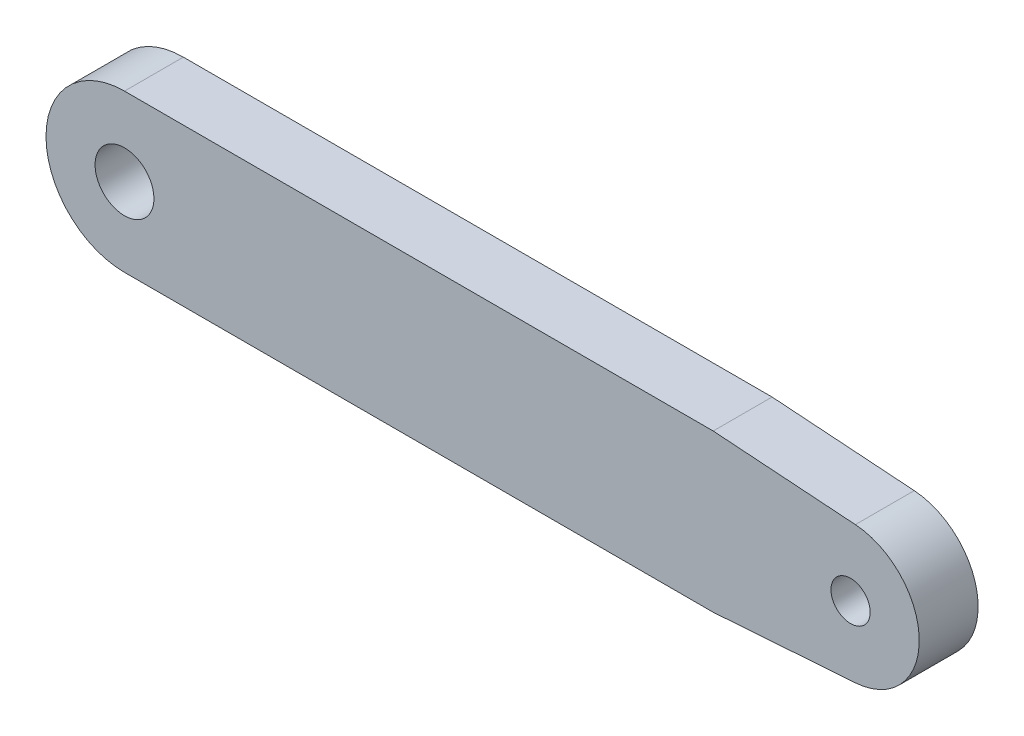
from build123d import *

# Parameters (mm, degrees)
ESQUISSE1_R        = 1.5
ESQUISSE1_R_2      = 1
BOSS_EXTRU_1_DEPTH = 3


with BuildPart() as part:
    # Esquisse1 → Boss.-Extru.1 (new body)
    with BuildSketch(Plane.XY):
        with BuildLine():
            Line((-37, 4), (-7, 4))
            Line((-7, 4), (0.245090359, 3.491408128))
            ThreePointArc((0.245090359, 3.491408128), (3.5, 0), (0.245090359, -3.491408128))
            Line((0.245090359, -3.491408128), (-7, -4))
            Line((-7, -4), (-37, -4))
            ThreePointArc((-37, -4), (-41, 0), (-37, 4))
        make_face()
        with Locations((-37, 0)):
            Circle(ESQUISSE1_R, mode=Mode.SUBTRACT)
        Circle(ESQUISSE1_R_2, mode=Mode.SUBTRACT)
    extrude(amount=BOSS_EXTRU_1_DEPTH)


solid = part.part
